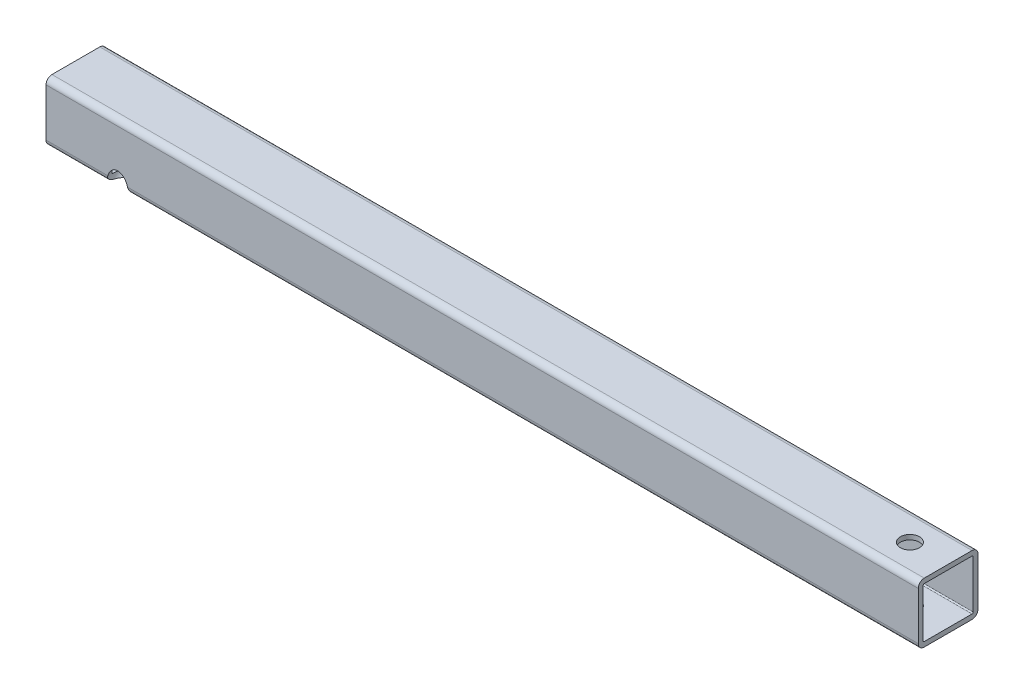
ISO-10303-21;
HEADER;
FILE_DESCRIPTION(('STEP AP214'),'2;1');
FILE_NAME('part.step','',(''),(''),'','','');
FILE_SCHEMA(('AUTOMOTIVE_DESIGN { 1 0 10303 214 1 1 1 1 }'));
ENDSEC;
DATA;
#1=APPLICATION_CONTEXT('core data for automotive mechanical design processes');
#2=APPLICATION_PROTOCOL_DEFINITION('international standard','automotive_design',2000,#1);
#3=PRODUCT_CONTEXT('',#1,'mechanical');
#4=PRODUCT('Part','Part','',(#3));
#5=PRODUCT_RELATED_PRODUCT_CATEGORY('part','',(#4));
#6=PRODUCT_DEFINITION_FORMATION('','',#4);
#7=PRODUCT_DEFINITION_CONTEXT('part definition',#1,'design');
#8=PRODUCT_DEFINITION('design','',#6,#7);
#9=PRODUCT_DEFINITION_SHAPE('','',#8);
#10=(LENGTH_UNIT() NAMED_UNIT(*) SI_UNIT(.MILLI.,.METRE.));
#11=(NAMED_UNIT(*) PLANE_ANGLE_UNIT() SI_UNIT($,.RADIAN.));
#12=(NAMED_UNIT(*) SI_UNIT($,.STERADIAN.) SOLID_ANGLE_UNIT());
#13=UNCERTAINTY_MEASURE_WITH_UNIT(LENGTH_MEASURE(1.E-05),#10,'distance_accuracy_value','');
#14=(GEOMETRIC_REPRESENTATION_CONTEXT(3) GLOBAL_UNCERTAINTY_ASSIGNED_CONTEXT((#13)) GLOBAL_UNIT_ASSIGNED_CONTEXT((#10,
#11,#12)) REPRESENTATION_CONTEXT('',''));
#15=CARTESIAN_POINT('',(0.,0.,0.));
#16=DIRECTION('',(0.,0.,1.));
#17=DIRECTION('',(1.,0.,0.));
#18=AXIS2_PLACEMENT_3D('',#15,#16,#17);
#19=CARTESIAN_POINT('',(365.,-10.,10.));
#20=DIRECTION('',(-1.,0.,0.));
#21=DIRECTION('',(0.,0.,1.));
#22=AXIS2_PLACEMENT_3D('',#19,#20,#21);
#23=CYLINDRICAL_SURFACE('',#22,2.5);
#24=DIRECTION('',(-1.,0.,0.));
#25=VECTOR('',#24,1.);
#26=CARTESIAN_POINT('',(365.,-9.99999999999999,12.5));
#27=LINE('',#26,#25);
#28=CARTESIAN_POINT('',(365.,-9.99999999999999,12.5));
#29=VERTEX_POINT('',#28);
#30=CARTESIAN_POINT('',(34.1382363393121,-9.99999999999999,12.5));
#31=VERTEX_POINT('',#30);
#32=EDGE_CURVE('E206',#29,#31,#27,.T.);
#33=ORIENTED_EDGE('',*,*,#32,.T.);
#34=CARTESIAN_POINT('',(34.1382363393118,-12.5,9.99999999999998));
#35=CARTESIAN_POINT('',(34.1587842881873,-12.4999928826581,10.0680174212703));
#36=CARTESIAN_POINT('',(34.1791785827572,-12.4972226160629,10.1360525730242));
#37=CARTESIAN_POINT('',(34.2192183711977,-12.4861052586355,10.2719220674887));
#38=CARTESIAN_POINT('',(34.2388634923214,-12.477755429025,10.3397562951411));
#39=CARTESIAN_POINT('',(34.2961355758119,-12.4441746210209,10.5430481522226));
#40=CARTESIAN_POINT('',(34.3319258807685,-12.4104114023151,10.6777409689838));
#41=CARTESIAN_POINT('',(34.3951296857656,-12.3200022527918,10.9418845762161));
#42=CARTESIAN_POINT('',(34.4225131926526,-12.2632760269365,11.071315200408));
#43=CARTESIAN_POINT('',(34.4656970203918,-12.1278395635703,11.3199405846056));
#44=CARTESIAN_POINT('',(34.4815271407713,-12.0491866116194,11.4391609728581));
#45=CARTESIAN_POINT('',(34.4990166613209,-11.879843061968,11.6532294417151));
#46=CARTESIAN_POINT('',(34.5017941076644,-11.7908063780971,11.7492971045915));
#47=CARTESIAN_POINT('',(34.495938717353,-11.5990054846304,11.9261859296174));
#48=CARTESIAN_POINT('',(34.487305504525,-11.496240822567,12.007006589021));
#49=CARTESIAN_POINT('',(34.4602823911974,-11.2863136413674,12.1472006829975));
#50=CARTESIAN_POINT('',(34.442447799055,-11.1796930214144,12.2075004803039));
#51=CARTESIAN_POINT('',(34.3989096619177,-10.9600700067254,12.3115054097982));
#52=CARTESIAN_POINT('',(34.3731972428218,-10.8470605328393,12.3551917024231));
#53=CARTESIAN_POINT('',(34.3147025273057,-10.612417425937,12.4270619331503));
#54=CARTESIAN_POINT('',(34.2816665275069,-10.4906213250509,12.4545093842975));
#55=CARTESIAN_POINT('',(34.2293878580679,-10.3069695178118,12.4818539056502));
#56=CARTESIAN_POINT('',(34.2115278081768,-10.2456578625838,12.4886643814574));
#57=CARTESIAN_POINT('',(34.175231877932,-10.1228923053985,12.4977341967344));
#58=CARTESIAN_POINT('',(34.1567962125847,-10.0614384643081,12.4999952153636));
#59=CARTESIAN_POINT('',(34.1382363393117,-10.,12.5));
#60=B_SPLINE_CURVE_WITH_KNOTS('',3,(#34,#35,#36,#37,#38,#39,#40,#41,#42,#43,#44,#45,#46,#47,#48,
#49,#50,#51,#52,#53,#54,#55,#56,#57,#58,#59),.UNSPECIFIED.,.F.,.F.,(4,2,2,2,2,2,2,2,2,2,2,2,4),
(0.,0.213047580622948,0.426199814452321,0.854225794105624,1.28376156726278,1.71218548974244,
2.10314834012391,2.49412407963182,2.86386745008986,3.23402886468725,3.61989764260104,
3.81242599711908,4.00488327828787),.UNSPECIFIED.);
#61=CARTESIAN_POINT('',(34.1382363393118,-12.5,9.99999999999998));
#62=VERTEX_POINT('',#61);
#63=EDGE_CURVE('E48',#62,#31,#60,.T.);
#64=ORIENTED_EDGE('',*,*,#63,.F.);
#65=DIRECTION('',(-1.,0.,0.));
#66=VECTOR('',#65,1.);
#67=CARTESIAN_POINT('',(365.,-12.5,9.99999999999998));
#68=LINE('',#67,#66);
#69=CARTESIAN_POINT('',(365.,-12.5,9.99999999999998));
#70=VERTEX_POINT('',#69);
#71=EDGE_CURVE('E11',#70,#62,#68,.T.);
#72=ORIENTED_EDGE('',*,*,#71,.F.);
#73=CARTESIAN_POINT('',(365.,-10.,10.));
#74=DIRECTION('',(1.,0.,0.));
#75=DIRECTION('',(0.,0.,-1.));
#76=AXIS2_PLACEMENT_3D('',#73,#74,#75);
#77=CIRCLE('',#76,2.5);
#78=EDGE_CURVE('E213',#29,#70,#77,.T.);
#79=ORIENTED_EDGE('',*,*,#78,.F.);
#80=EDGE_LOOP('',(#33,#64,#72,#79));
#81=FACE_BOUND('',#80,.T.);
#82=ADVANCED_FACE('F32',(#81),#23,.T.);
#83=CARTESIAN_POINT('',(365.,-10.,10.));
#84=DIRECTION('',(-1.,0.,0.));
#85=DIRECTION('',(0.,0.,1.));
#86=AXIS2_PLACEMENT_3D('',#83,#84,#85);
#87=CYLINDRICAL_SURFACE('',#86,0.5);
#88=CARTESIAN_POINT('',(34.4860896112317,-10.5,9.99999999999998));
#89=CARTESIAN_POINT('',(34.4876586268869,-10.5000230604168,10.0280963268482));
#90=CARTESIAN_POINT('',(34.4892206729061,-10.497633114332,10.0561876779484));
#91=CARTESIAN_POINT('',(34.4921701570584,-10.4881949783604,10.1115710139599));
#92=CARTESIAN_POINT('',(34.4935576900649,-10.4811493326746,10.1388634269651));
#93=CARTESIAN_POINT('',(34.496000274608,-10.4625616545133,10.191907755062));
#94=CARTESIAN_POINT('',(34.4970551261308,-10.4510169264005,10.2176587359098));
#95=CARTESIAN_POINT('',(34.4987132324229,-10.4237633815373,10.2668610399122));
#96=CARTESIAN_POINT('',(34.4993166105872,-10.4080557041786,10.2903129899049));
#97=CARTESIAN_POINT('',(34.500002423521,-10.3729887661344,10.3341624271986));
#98=CARTESIAN_POINT('',(34.500086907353,-10.3536441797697,10.3545716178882));
#99=CARTESIAN_POINT('',(34.4997309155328,-10.3118105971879,10.3918665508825));
#100=CARTESIAN_POINT('',(34.4992903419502,-10.2893210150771,10.4087516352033));
#101=CARTESIAN_POINT('',(34.4979353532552,-10.2419040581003,10.4384791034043));
#102=CARTESIAN_POINT('',(34.4970220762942,-10.2169826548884,10.4513310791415));
#103=CARTESIAN_POINT('',(34.4948239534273,-10.1653632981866,10.472688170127));
#104=CARTESIAN_POINT('',(34.4935392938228,-10.1386662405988,10.4811954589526));
#105=CARTESIAN_POINT('',(34.4912011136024,-10.0931841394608,10.4915986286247));
#106=CARTESIAN_POINT('',(34.4902097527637,-10.0746724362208,10.4947474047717));
#107=CARTESIAN_POINT('',(34.4881758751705,-10.0374429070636,10.4989477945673));
#108=CARTESIAN_POINT('',(34.4871334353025,-10.0187254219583,10.5000024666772));
#109=CARTESIAN_POINT('',(34.4860896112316,-10.,10.5));
#110=B_SPLINE_CURVE_WITH_KNOTS('',3,(#88,#89,#90,#91,#92,#93,#94,#95,#96,#97,#98,#99,#100,#101,
#102,#103,#104,#105,#106,#107,#108,#109),.UNSPECIFIED.,.F.,.F.,(4,2,2,2,2,2,2,2,2,2,4),(0.,
0.0843116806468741,0.168577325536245,0.252893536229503,0.337186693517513,0.421146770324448,
0.50512250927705,0.588896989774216,0.672629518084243,0.728930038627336,0.785148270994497),.UNSPECIFIED.);
#111=CARTESIAN_POINT('',(34.4860896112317,-10.5,9.99999999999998));
#112=VERTEX_POINT('',#111);
#113=CARTESIAN_POINT('',(34.4860896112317,-10.,10.5));
#114=VERTEX_POINT('',#113);
#115=EDGE_CURVE('E330',#112,#114,#110,.T.);
#116=ORIENTED_EDGE('',*,*,#115,.T.);
#117=DIRECTION('',(-1.,0.,0.));
#118=VECTOR('',#117,1.);
#119=CARTESIAN_POINT('',(365.,-10.,10.5));
#120=LINE('',#119,#118);
#121=CARTESIAN_POINT('',(365.,-10.,10.5));
#122=VERTEX_POINT('',#121);
#123=EDGE_CURVE('E246',#122,#114,#120,.T.);
#124=ORIENTED_EDGE('',*,*,#123,.F.);
#125=CARTESIAN_POINT('',(365.,-10.,10.));
#126=DIRECTION('',(1.,0.,0.));
#127=DIRECTION('',(0.,0.,-1.));
#128=AXIS2_PLACEMENT_3D('',#125,#126,#127);
#129=CIRCLE('',#128,0.5);
#130=CARTESIAN_POINT('',(365.,-10.5,9.99999999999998));
#131=VERTEX_POINT('',#130);
#132=EDGE_CURVE('E302',#122,#131,#129,.T.);
#133=ORIENTED_EDGE('',*,*,#132,.T.);
#134=DIRECTION('',(-1.,0.,0.));
#135=VECTOR('',#134,1.);
#136=CARTESIAN_POINT('',(365.,-10.5,9.99999999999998));
#137=LINE('',#136,#135);
#138=EDGE_CURVE('E250',#131,#112,#137,.T.);
#139=ORIENTED_EDGE('',*,*,#138,.T.);
#140=EDGE_LOOP('',(#116,#124,#133,#139));
#141=FACE_BOUND('',#140,.T.);
#142=ADVANCED_FACE('F369',(#141),#87,.F.);
#143=CARTESIAN_POINT('',(365.,-12.5,9.99999999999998));
#144=DIRECTION('',(0.,1.,0.));
#145=DIRECTION('',(0.,0.,1.));
#146=AXIS2_PLACEMENT_3D('',#143,#144,#145);
#147=PLANE('',#146);
#148=ORIENTED_EDGE('',*,*,#71,.T.);
#149=CARTESIAN_POINT('',(30.,-12.5,12.5));
#150=DIRECTION('',(0.,1.,0.));
#151=DIRECTION('',(0.,0.,1.));
#152=AXIS2_PLACEMENT_3D('',#149,#150,#151);
#153=ELLIPSE('',#152,6.36396103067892,4.5);
#154=CARTESIAN_POINT('',(25.8617636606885,-12.5,9.99999999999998));
#155=VERTEX_POINT('',#154);
#156=EDGE_CURVE('E171',#155,#62,#153,.F.);
#157=ORIENTED_EDGE('',*,*,#156,.F.);
#158=CARTESIAN_POINT('',(0.,-12.5,9.99999999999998));
#159=VERTEX_POINT('',#158);
#160=EDGE_CURVE('E41',#155,#159,#68,.T.);
#161=ORIENTED_EDGE('',*,*,#160,.T.);
#162=DIRECTION('',(0.,0.,-1.));
#163=VECTOR('',#162,1.);
#164=CARTESIAN_POINT('',(0.,-12.5,9.99999999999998));
#165=LINE('',#164,#163);
#166=CARTESIAN_POINT('',(0.,-12.5,-9.99999999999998));
#167=VERTEX_POINT('',#166);
#168=EDGE_CURVE('E224',#159,#167,#165,.T.);
#169=ORIENTED_EDGE('',*,*,#168,.T.);
#170=DIRECTION('',(-1.,0.,0.));
#171=VECTOR('',#170,1.);
#172=CARTESIAN_POINT('',(365.,-12.5,-9.99999999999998));
#173=LINE('',#172,#171);
#174=CARTESIAN_POINT('',(365.,-12.5,-9.99999999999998));
#175=VERTEX_POINT('',#174);
#176=EDGE_CURVE('E187',#175,#167,#173,.T.);
#177=ORIENTED_EDGE('',*,*,#176,.F.);
#178=DIRECTION('',(0.,0.,-1.));
#179=VECTOR('',#178,1.);
#180=CARTESIAN_POINT('',(365.,-12.5,9.99999999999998));
#181=LINE('',#180,#179);
#182=EDGE_CURVE('E240',#70,#175,#181,.T.);
#183=ORIENTED_EDGE('',*,*,#182,.F.);
#184=EDGE_LOOP('',(#148,#157,#161,#169,#177,#183));
#185=FACE_BOUND('',#184,.T.);
#186=CARTESIAN_POINT('',(349.,-12.5,0.));
#187=DIRECTION('',(0.,-1.,0.));
#188=DIRECTION('',(0.,0.,-1.));
#189=AXIS2_PLACEMENT_3D('',#186,#187,#188);
#190=CIRCLE('',#189,3.99999999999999);
#191=CARTESIAN_POINT('',(349.,-12.5,-3.99999999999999));
#192=VERTEX_POINT('',#191);
#193=EDGE_CURVE('E311',#192,#192,#190,.T.);
#194=ORIENTED_EDGE('',*,*,#193,.F.);
#195=EDGE_LOOP('',(#194));
#196=FACE_BOUND('',#195,.T.);
#197=ADVANCED_FACE('F178',(#185,#196),#147,.F.);
#198=CARTESIAN_POINT('',(365.,12.5,9.99999999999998));
#199=DIRECTION('',(0.,-1.,0.));
#200=DIRECTION('',(0.,0.,-1.));
#201=AXIS2_PLACEMENT_3D('',#198,#199,#200);
#202=PLANE('',#201);
#203=DIRECTION('',(0.,0.,1.));
#204=VECTOR('',#203,1.);
#205=CARTESIAN_POINT('',(0.,12.5,9.99999999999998));
#206=LINE('',#205,#204);
#207=CARTESIAN_POINT('',(0.,12.5,-9.99999999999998));
#208=VERTEX_POINT('',#207);
#209=CARTESIAN_POINT('',(0.,12.5,9.99999999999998));
#210=VERTEX_POINT('',#209);
#211=EDGE_CURVE('E216',#208,#210,#206,.T.);
#212=ORIENTED_EDGE('',*,*,#211,.T.);
#213=DIRECTION('',(-1.,0.,0.));
#214=VECTOR('',#213,1.);
#215=CARTESIAN_POINT('',(365.,12.5,9.99999999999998));
#216=LINE('',#215,#214);
#217=CARTESIAN_POINT('',(365.,12.5,9.99999999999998));
#218=VERTEX_POINT('',#217);
#219=EDGE_CURVE('E200',#218,#210,#216,.T.);
#220=ORIENTED_EDGE('',*,*,#219,.F.);
#221=DIRECTION('',(0.,0.,1.));
#222=VECTOR('',#221,1.);
#223=CARTESIAN_POINT('',(365.,12.5,9.99999999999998));
#224=LINE('',#223,#222);
#225=CARTESIAN_POINT('',(365.,12.5,-9.99999999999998));
#226=VERTEX_POINT('',#225);
#227=EDGE_CURVE('E232',#226,#218,#224,.T.);
#228=ORIENTED_EDGE('',*,*,#227,.F.);
#229=DIRECTION('',(-1.,0.,0.));
#230=VECTOR('',#229,1.);
#231=CARTESIAN_POINT('',(365.,12.5,-9.99999999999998));
#232=LINE('',#231,#230);
#233=EDGE_CURVE('E197',#226,#208,#232,.T.);
#234=ORIENTED_EDGE('',*,*,#233,.T.);
#235=EDGE_LOOP('',(#212,#220,#228,#234));
#236=FACE_BOUND('',#235,.T.);
#237=CARTESIAN_POINT('',(349.,12.5,0.));
#238=DIRECTION('',(0.,-1.,0.));
#239=DIRECTION('',(0.,0.,-1.));
#240=AXIS2_PLACEMENT_3D('',#237,#238,#239);
#241=CIRCLE('',#240,3.99999999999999);
#242=CARTESIAN_POINT('',(349.,12.5,-3.99999999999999));
#243=VERTEX_POINT('',#242);
#244=EDGE_CURVE('E182',#243,#243,#241,.T.);
#245=ORIENTED_EDGE('',*,*,#244,.T.);
#246=EDGE_LOOP('',(#245));
#247=FACE_BOUND('',#246,.T.);
#248=ADVANCED_FACE('F403',(#236,#247),#202,.F.);
#249=CARTESIAN_POINT('',(365.,-10.5,9.99999999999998));
#250=DIRECTION('',(0.,1.,0.));
#251=DIRECTION('',(0.,0.,1.));
#252=AXIS2_PLACEMENT_3D('',#249,#250,#251);
#253=PLANE('',#252);
#254=CARTESIAN_POINT('',(30.,-10.5,10.5));
#255=DIRECTION('',(0.,1.,0.));
#256=DIRECTION('',(0.,0.,1.));
#257=AXIS2_PLACEMENT_3D('',#254,#255,#256);
#258=ELLIPSE('',#257,6.36396103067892,4.5);
#259=CARTESIAN_POINT('',(25.5139103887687,-10.5,9.99999999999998));
#260=VERTEX_POINT('',#259);
#261=EDGE_CURVE('E56',#260,#112,#258,.F.);
#262=ORIENTED_EDGE('',*,*,#261,.T.);
#263=ORIENTED_EDGE('',*,*,#138,.F.);
#264=DIRECTION('',(0.,0.,-1.));
#265=VECTOR('',#264,1.);
#266=CARTESIAN_POINT('',(365.,-10.5,9.99999999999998));
#267=LINE('',#266,#265);
#268=CARTESIAN_POINT('',(365.,-10.5,-10.));
#269=VERTEX_POINT('',#268);
#270=EDGE_CURVE('E300',#131,#269,#267,.T.);
#271=ORIENTED_EDGE('',*,*,#270,.T.);
#272=DIRECTION('',(-1.,0.,0.));
#273=VECTOR('',#272,1.);
#274=CARTESIAN_POINT('',(365.,-10.5,-10.));
#275=LINE('',#274,#273);
#276=CARTESIAN_POINT('',(0.,-10.5,-10.));
#277=VERTEX_POINT('',#276);
#278=EDGE_CURVE('E254',#269,#277,#275,.T.);
#279=ORIENTED_EDGE('',*,*,#278,.T.);
#280=DIRECTION('',(0.,0.,-1.));
#281=VECTOR('',#280,1.);
#282=CARTESIAN_POINT('',(0.,-10.5,9.99999999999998));
#283=LINE('',#282,#281);
#284=CARTESIAN_POINT('',(0.,-10.5,9.99999999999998));
#285=VERTEX_POINT('',#284);
#286=EDGE_CURVE('E279',#285,#277,#283,.T.);
#287=ORIENTED_EDGE('',*,*,#286,.F.);
#288=EDGE_CURVE('E253',#260,#285,#137,.T.);
#289=ORIENTED_EDGE('',*,*,#288,.F.);
#290=EDGE_LOOP('',(#262,#263,#271,#279,#287,#289));
#291=FACE_BOUND('',#290,.T.);
#292=CARTESIAN_POINT('',(349.,-10.5,0.));
#293=DIRECTION('',(0.,1.,0.));
#294=DIRECTION('',(0.,0.,1.));
#295=AXIS2_PLACEMENT_3D('',#292,#293,#294);
#296=CIRCLE('',#295,3.99999999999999);
#297=CARTESIAN_POINT('',(349.,-10.5,3.99999999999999));
#298=VERTEX_POINT('',#297);
#299=EDGE_CURVE('E291',#298,#298,#296,.F.);
#300=ORIENTED_EDGE('',*,*,#299,.T.);
#301=EDGE_LOOP('',(#300));
#302=FACE_BOUND('',#301,.T.);
#303=ADVANCED_FACE('F372',(#291,#302),#253,.T.);
#304=CARTESIAN_POINT('',(365.,10.5,9.99999999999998));
#305=DIRECTION('',(0.,-1.,0.));
#306=DIRECTION('',(0.,0.,-1.));
#307=AXIS2_PLACEMENT_3D('',#304,#305,#306);
#308=PLANE('',#307);
#309=DIRECTION('',(0.,0.,1.));
#310=VECTOR('',#309,1.);
#311=CARTESIAN_POINT('',(0.,10.5,9.99999999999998));
#312=LINE('',#311,#310);
#313=CARTESIAN_POINT('',(0.,10.5,-9.99999999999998));
#314=VERTEX_POINT('',#313);
#315=CARTESIAN_POINT('',(0.,10.5,9.99999999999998));
#316=VERTEX_POINT('',#315);
#317=EDGE_CURVE('E266',#314,#316,#312,.T.);
#318=ORIENTED_EDGE('',*,*,#317,.F.);
#319=DIRECTION('',(-1.,0.,0.));
#320=VECTOR('',#319,1.);
#321=CARTESIAN_POINT('',(365.,10.5,-9.99999999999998));
#322=LINE('',#321,#320);
#323=CARTESIAN_POINT('',(365.,10.5,-9.99999999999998));
#324=VERTEX_POINT('',#323);
#325=EDGE_CURVE('E260',#324,#314,#322,.T.);
#326=ORIENTED_EDGE('',*,*,#325,.F.);
#327=DIRECTION('',(0.,0.,1.));
#328=VECTOR('',#327,1.);
#329=CARTESIAN_POINT('',(365.,10.5,9.99999999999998));
#330=LINE('',#329,#328);
#331=CARTESIAN_POINT('',(365.,10.5,9.99999999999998));
#332=VERTEX_POINT('',#331);
#333=EDGE_CURVE('E265',#324,#332,#330,.T.);
#334=ORIENTED_EDGE('',*,*,#333,.T.);
#335=DIRECTION('',(-1.,0.,0.));
#336=VECTOR('',#335,1.);
#337=CARTESIAN_POINT('',(365.,10.5,9.99999999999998));
#338=LINE('',#337,#336);
#339=EDGE_CURVE('E262',#332,#316,#338,.T.);
#340=ORIENTED_EDGE('',*,*,#339,.T.);
#341=EDGE_LOOP('',(#318,#326,#334,#340));
#342=FACE_BOUND('',#341,.T.);
#343=CARTESIAN_POINT('',(349.,10.5,0.));
#344=DIRECTION('',(0.,-1.,0.));
#345=DIRECTION('',(0.,0.,-1.));
#346=AXIS2_PLACEMENT_3D('',#343,#344,#345);
#347=CIRCLE('',#346,3.99999999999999);
#348=CARTESIAN_POINT('',(349.,10.5,-3.99999999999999));
#349=VERTEX_POINT('',#348);
#350=EDGE_CURVE('E36',#349,#349,#347,.F.);
#351=ORIENTED_EDGE('',*,*,#350,.T.);
#352=EDGE_LOOP('',(#351));
#353=FACE_BOUND('',#352,.T.);
#354=ADVANCED_FACE('F390',(#342,#353),#308,.T.);
#355=CARTESIAN_POINT('',(365.,-10.,10.));
#356=DIRECTION('',(1.,0.,0.));
#357=DIRECTION('',(0.,0.,-1.));
#358=AXIS2_PLACEMENT_3D('',#355,#356,#357);
#359=PLANE('',#358);
#360=ORIENTED_EDGE('',*,*,#78,.T.);
#361=ORIENTED_EDGE('',*,*,#182,.T.);
#362=CARTESIAN_POINT('',(365.,-10.,-10.));
#363=DIRECTION('',(1.,0.,0.));
#364=DIRECTION('',(0.,0.,-1.));
#365=AXIS2_PLACEMENT_3D('',#362,#363,#364);
#366=CIRCLE('',#365,2.5);
#367=CARTESIAN_POINT('',(365.,-9.99999999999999,-12.5));
#368=VERTEX_POINT('',#367);
#369=EDGE_CURVE('E238',#175,#368,#366,.T.);
#370=ORIENTED_EDGE('',*,*,#369,.T.);
#371=DIRECTION('',(0.,1.,0.));
#372=VECTOR('',#371,1.);
#373=CARTESIAN_POINT('',(365.,9.99999999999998,-12.5));
#374=LINE('',#373,#372);
#375=CARTESIAN_POINT('',(365.,9.99999999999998,-12.5));
#376=VERTEX_POINT('',#375);
#377=EDGE_CURVE('E236',#368,#376,#374,.T.);
#378=ORIENTED_EDGE('',*,*,#377,.T.);
#379=CARTESIAN_POINT('',(365.,10.,-10.));
#380=DIRECTION('',(1.,0.,0.));
#381=DIRECTION('',(0.,0.,1.));
#382=AXIS2_PLACEMENT_3D('',#379,#380,#381);
#383=CIRCLE('',#382,2.5);
#384=EDGE_CURVE('E234',#376,#226,#383,.T.);
#385=ORIENTED_EDGE('',*,*,#384,.T.);
#386=ORIENTED_EDGE('',*,*,#227,.T.);
#387=CARTESIAN_POINT('',(365.,10.,10.));
#388=DIRECTION('',(1.,0.,0.));
#389=DIRECTION('',(0.,0.,-1.));
#390=AXIS2_PLACEMENT_3D('',#387,#388,#389);
#391=CIRCLE('',#390,2.5);
#392=CARTESIAN_POINT('',(365.,9.99999999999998,12.5));
#393=VERTEX_POINT('',#392);
#394=EDGE_CURVE('E230',#218,#393,#391,.T.);
#395=ORIENTED_EDGE('',*,*,#394,.T.);
#396=DIRECTION('',(0.,-1.,0.));
#397=VECTOR('',#396,1.);
#398=CARTESIAN_POINT('',(365.,9.99999999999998,12.5));
#399=LINE('',#398,#397);
#400=EDGE_CURVE('E228',#393,#29,#399,.T.);
#401=ORIENTED_EDGE('',*,*,#400,.T.);
#402=EDGE_LOOP('',(#360,#361,#370,#378,#385,#386,#395,#401));
#403=FACE_BOUND('',#402,.T.);
#404=DIRECTION('',(0.,-1.,0.));
#405=VECTOR('',#404,1.);
#406=CARTESIAN_POINT('',(365.,9.99999999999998,10.5));
#407=LINE('',#406,#405);
#408=CARTESIAN_POINT('',(365.,9.99999999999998,10.5));
#409=VERTEX_POINT('',#408);
#410=EDGE_CURVE('E304',#409,#122,#407,.T.);
#411=ORIENTED_EDGE('',*,*,#410,.F.);
#412=CARTESIAN_POINT('',(365.,10.,10.));
#413=DIRECTION('',(1.,0.,0.));
#414=DIRECTION('',(0.,0.,-1.));
#415=AXIS2_PLACEMENT_3D('',#412,#413,#414);
#416=CIRCLE('',#415,0.5);
#417=EDGE_CURVE('E269',#332,#409,#416,.T.);
#418=ORIENTED_EDGE('',*,*,#417,.F.);
#419=ORIENTED_EDGE('',*,*,#333,.F.);
#420=CARTESIAN_POINT('',(365.,10.,-10.));
#421=DIRECTION('',(1.,0.,0.));
#422=DIRECTION('',(0.,0.,1.));
#423=AXIS2_PLACEMENT_3D('',#420,#421,#422);
#424=CIRCLE('',#423,0.5);
#425=CARTESIAN_POINT('',(365.,9.99999999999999,-10.5));
#426=VERTEX_POINT('',#425);
#427=EDGE_CURVE('E293',#426,#324,#424,.T.);
#428=ORIENTED_EDGE('',*,*,#427,.F.);
#429=DIRECTION('',(0.,1.,0.));
#430=VECTOR('',#429,1.);
#431=CARTESIAN_POINT('',(365.,9.99999999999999,-10.5));
#432=LINE('',#431,#430);
#433=CARTESIAN_POINT('',(365.,-9.99999999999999,-10.5));
#434=VERTEX_POINT('',#433);
#435=EDGE_CURVE('E296',#434,#426,#432,.T.);
#436=ORIENTED_EDGE('',*,*,#435,.F.);
#437=CARTESIAN_POINT('',(365.,-10.,-10.));
#438=DIRECTION('',(1.,0.,0.));
#439=DIRECTION('',(0.,0.,-1.));
#440=AXIS2_PLACEMENT_3D('',#437,#438,#439);
#441=CIRCLE('',#440,0.499999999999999);
#442=EDGE_CURVE('E298',#269,#434,#441,.T.);
#443=ORIENTED_EDGE('',*,*,#442,.F.);
#444=ORIENTED_EDGE('',*,*,#270,.F.);
#445=ORIENTED_EDGE('',*,*,#132,.F.);
#446=EDGE_LOOP('',(#411,#418,#419,#428,#436,#443,#444,#445));
#447=FACE_BOUND('',#446,.T.);
#448=ADVANCED_FACE('F364',(#403,#447),#359,.T.);
#449=CARTESIAN_POINT('',(0.,-10.,10.));
#450=DIRECTION('',(1.,0.,0.));
#451=DIRECTION('',(0.,0.,-1.));
#452=AXIS2_PLACEMENT_3D('',#449,#450,#451);
#453=PLANE('',#452);
#454=CARTESIAN_POINT('',(0.,-10.,10.));
#455=DIRECTION('',(1.,0.,0.));
#456=DIRECTION('',(0.,0.,-1.));
#457=AXIS2_PLACEMENT_3D('',#454,#455,#456);
#458=CIRCLE('',#457,2.5);
#459=CARTESIAN_POINT('',(0.,-9.99999999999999,12.5));
#460=VERTEX_POINT('',#459);
#461=EDGE_CURVE('E186',#460,#159,#458,.T.);
#462=ORIENTED_EDGE('',*,*,#461,.F.);
#463=DIRECTION('',(0.,-1.,0.));
#464=VECTOR('',#463,1.);
#465=CARTESIAN_POINT('',(0.,9.99999999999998,12.5));
#466=LINE('',#465,#464);
#467=CARTESIAN_POINT('',(0.,9.99999999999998,12.5));
#468=VERTEX_POINT('',#467);
#469=EDGE_CURVE('E210',#468,#460,#466,.T.);
#470=ORIENTED_EDGE('',*,*,#469,.F.);
#471=CARTESIAN_POINT('',(0.,10.,10.));
#472=DIRECTION('',(1.,0.,0.));
#473=DIRECTION('',(0.,0.,-1.));
#474=AXIS2_PLACEMENT_3D('',#471,#472,#473);
#475=CIRCLE('',#474,2.5);
#476=EDGE_CURVE('E214',#210,#468,#475,.T.);
#477=ORIENTED_EDGE('',*,*,#476,.F.);
#478=ORIENTED_EDGE('',*,*,#211,.F.);
#479=CARTESIAN_POINT('',(0.,10.,-10.));
#480=DIRECTION('',(1.,0.,0.));
#481=DIRECTION('',(0.,0.,1.));
#482=AXIS2_PLACEMENT_3D('',#479,#480,#481);
#483=CIRCLE('',#482,2.5);
#484=CARTESIAN_POINT('',(0.,9.99999999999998,-12.5));
#485=VERTEX_POINT('',#484);
#486=EDGE_CURVE('E218',#485,#208,#483,.T.);
#487=ORIENTED_EDGE('',*,*,#486,.F.);
#488=DIRECTION('',(0.,1.,0.));
#489=VECTOR('',#488,1.);
#490=CARTESIAN_POINT('',(0.,9.99999999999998,-12.5));
#491=LINE('',#490,#489);
#492=CARTESIAN_POINT('',(0.,-9.99999999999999,-12.5));
#493=VERTEX_POINT('',#492);
#494=EDGE_CURVE('E220',#493,#485,#491,.T.);
#495=ORIENTED_EDGE('',*,*,#494,.F.);
#496=CARTESIAN_POINT('',(0.,-10.,-10.));
#497=DIRECTION('',(1.,0.,0.));
#498=DIRECTION('',(0.,0.,-1.));
#499=AXIS2_PLACEMENT_3D('',#496,#497,#498);
#500=CIRCLE('',#499,2.5);
#501=EDGE_CURVE('E222',#167,#493,#500,.T.);
#502=ORIENTED_EDGE('',*,*,#501,.F.);
#503=ORIENTED_EDGE('',*,*,#168,.F.);
#504=EDGE_LOOP('',(#462,#470,#477,#478,#487,#495,#502,#503));
#505=FACE_BOUND('',#504,.T.);
#506=CARTESIAN_POINT('',(0.,10.,10.));
#507=DIRECTION('',(1.,0.,0.));
#508=DIRECTION('',(0.,0.,-1.));
#509=AXIS2_PLACEMENT_3D('',#506,#507,#508);
#510=CIRCLE('',#509,0.5);
#511=CARTESIAN_POINT('',(0.,9.99999999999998,10.5));
#512=VERTEX_POINT('',#511);
#513=EDGE_CURVE('E288',#316,#512,#510,.T.);
#514=ORIENTED_EDGE('',*,*,#513,.T.);
#515=DIRECTION('',(0.,-1.,0.));
#516=VECTOR('',#515,1.);
#517=CARTESIAN_POINT('',(0.,9.99999999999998,10.5));
#518=LINE('',#517,#516);
#519=CARTESIAN_POINT('',(0.,-10.,10.5));
#520=VERTEX_POINT('',#519);
#521=EDGE_CURVE('E285',#512,#520,#518,.T.);
#522=ORIENTED_EDGE('',*,*,#521,.T.);
#523=CARTESIAN_POINT('',(0.,-10.,10.));
#524=DIRECTION('',(1.,0.,0.));
#525=DIRECTION('',(0.,0.,-1.));
#526=AXIS2_PLACEMENT_3D('',#523,#524,#525);
#527=CIRCLE('',#526,0.5);
#528=EDGE_CURVE('E282',#520,#285,#527,.T.);
#529=ORIENTED_EDGE('',*,*,#528,.T.);
#530=ORIENTED_EDGE('',*,*,#286,.T.);
#531=CARTESIAN_POINT('',(0.,-10.,-10.));
#532=DIRECTION('',(1.,0.,0.));
#533=DIRECTION('',(0.,0.,-1.));
#534=AXIS2_PLACEMENT_3D('',#531,#532,#533);
#535=CIRCLE('',#534,0.499999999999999);
#536=CARTESIAN_POINT('',(0.,-9.99999999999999,-10.5));
#537=VERTEX_POINT('',#536);
#538=EDGE_CURVE('E276',#277,#537,#535,.T.);
#539=ORIENTED_EDGE('',*,*,#538,.T.);
#540=DIRECTION('',(0.,1.,0.));
#541=VECTOR('',#540,1.);
#542=CARTESIAN_POINT('',(0.,9.99999999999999,-10.5));
#543=LINE('',#542,#541);
#544=CARTESIAN_POINT('',(0.,9.99999999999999,-10.5));
#545=VERTEX_POINT('',#544);
#546=EDGE_CURVE('E273',#537,#545,#543,.T.);
#547=ORIENTED_EDGE('',*,*,#546,.T.);
#548=CARTESIAN_POINT('',(0.,10.,-10.));
#549=DIRECTION('',(1.,0.,0.));
#550=DIRECTION('',(0.,0.,1.));
#551=AXIS2_PLACEMENT_3D('',#548,#549,#550);
#552=CIRCLE('',#551,0.5);
#553=EDGE_CURVE('E270',#545,#314,#552,.T.);
#554=ORIENTED_EDGE('',*,*,#553,.T.);
#555=ORIENTED_EDGE('',*,*,#317,.T.);
#556=EDGE_LOOP('',(#514,#522,#529,#530,#539,#547,#554,#555));
#557=FACE_BOUND('',#556,.T.);
#558=ADVANCED_FACE('F355',(#505,#557),#453,.F.);
#559=ORIENTED_EDGE('',*,*,#160,.F.);
#560=CARTESIAN_POINT('',(25.8617636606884,-9.99999999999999,12.5));
#561=CARTESIAN_POINT('',(25.8412157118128,-10.0680174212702,12.4999928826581));
#562=CARTESIAN_POINT('',(25.8208214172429,-10.1360525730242,12.4972226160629));
#563=CARTESIAN_POINT('',(25.7807816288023,-10.2719220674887,12.4861052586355));
#564=CARTESIAN_POINT('',(25.7611365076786,-10.3397562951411,12.477755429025));
#565=CARTESIAN_POINT('',(25.7038644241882,-10.5430481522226,12.4441746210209));
#566=CARTESIAN_POINT('',(25.6680741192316,-10.6777409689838,12.4104114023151));
#567=CARTESIAN_POINT('',(25.6048703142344,-10.9418845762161,12.3200022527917));
#568=CARTESIAN_POINT('',(25.5774868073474,-11.071315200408,12.2632760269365));
#569=CARTESIAN_POINT('',(25.5343029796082,-11.3199405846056,12.1278395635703));
#570=CARTESIAN_POINT('',(25.5184728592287,-11.4391609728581,12.0491866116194));
#571=CARTESIAN_POINT('',(25.5009833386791,-11.6532294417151,11.879843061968));
#572=CARTESIAN_POINT('',(25.4982058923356,-11.7492971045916,11.7908063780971));
#573=CARTESIAN_POINT('',(25.5040612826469,-11.9261859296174,11.5990054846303));
#574=CARTESIAN_POINT('',(25.512694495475,-12.0070065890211,11.4962408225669));
#575=CARTESIAN_POINT('',(25.5397176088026,-12.1472006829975,11.2863136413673));
#576=CARTESIAN_POINT('',(25.557552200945,-12.207500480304,11.1796930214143));
#577=CARTESIAN_POINT('',(25.6010903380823,-12.3115054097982,10.9600700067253));
#578=CARTESIAN_POINT('',(25.6268027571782,-12.3551917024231,10.8470605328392));
#579=CARTESIAN_POINT('',(25.6852974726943,-12.4270619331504,10.6124174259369));
#580=CARTESIAN_POINT('',(25.7183334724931,-12.4545093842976,10.4906213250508));
#581=CARTESIAN_POINT('',(25.7706121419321,-12.4818539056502,10.3069695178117));
#582=CARTESIAN_POINT('',(25.7884721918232,-12.4886643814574,10.2456578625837));
#583=CARTESIAN_POINT('',(25.824768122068,-12.4977341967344,10.1228923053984));
#584=CARTESIAN_POINT('',(25.8432037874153,-12.4999952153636,10.061438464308));
#585=CARTESIAN_POINT('',(25.8617636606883,-12.5,9.99999999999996));
#586=B_SPLINE_CURVE_WITH_KNOTS('',3,(#560,#561,#562,#563,#564,#565,#566,#567,#568,#569,#570,
#571,#572,#573,#574,#575,#576,#577,#578,#579,#580,#581,#582,#583,#584,#585),.UNSPECIFIED.,.F.,
.F.,(4,2,2,2,2,2,2,2,2,2,2,2,4),(0.,0.21304758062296,0.426199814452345,0.854225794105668,
1.28376156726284,1.71218548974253,2.10314834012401,2.49412407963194,2.86386745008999,
3.23402886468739,3.61989764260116,3.81242599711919,4.00488327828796),.UNSPECIFIED.);
#587=CARTESIAN_POINT('',(25.8617636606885,-9.99999999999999,12.5));
#588=VERTEX_POINT('',#587);
#589=EDGE_CURVE('E168',#588,#155,#586,.T.);
#590=ORIENTED_EDGE('',*,*,#589,.F.);
#591=EDGE_CURVE('E209',#588,#460,#27,.T.);
#592=ORIENTED_EDGE('',*,*,#591,.T.);
#593=ORIENTED_EDGE('',*,*,#461,.T.);
#594=EDGE_LOOP('',(#559,#590,#592,#593));
#595=FACE_BOUND('',#594,.T.);
#596=ADVANCED_FACE('F34',(#595),#23,.T.);
#597=CARTESIAN_POINT('',(365.,-10.,-10.));
#598=DIRECTION('',(-1.,0.,0.));
#599=DIRECTION('',(0.,0.,1.));
#600=AXIS2_PLACEMENT_3D('',#597,#598,#599);
#601=CYLINDRICAL_SURFACE('',#600,2.5);
#602=ORIENTED_EDGE('',*,*,#501,.T.);
#603=DIRECTION('',(-1.,0.,0.));
#604=VECTOR('',#603,1.);
#605=CARTESIAN_POINT('',(365.,-9.99999999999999,-12.5));
#606=LINE('',#605,#604);
#607=EDGE_CURVE('E189',#368,#493,#606,.T.);
#608=ORIENTED_EDGE('',*,*,#607,.F.);
#609=ORIENTED_EDGE('',*,*,#369,.F.);
#610=ORIENTED_EDGE('',*,*,#176,.T.);
#611=EDGE_LOOP('',(#602,#608,#609,#610));
#612=FACE_BOUND('',#611,.T.);
#613=ADVANCED_FACE('F421',(#612),#601,.T.);
#614=CARTESIAN_POINT('',(365.,9.99999999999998,-12.5));
#615=DIRECTION('',(0.,0.,1.));
#616=DIRECTION('',(0.,-1.,0.));
#617=AXIS2_PLACEMENT_3D('',#614,#615,#616);
#618=PLANE('',#617);
#619=ORIENTED_EDGE('',*,*,#494,.T.);
#620=DIRECTION('',(-1.,0.,0.));
#621=VECTOR('',#620,1.);
#622=CARTESIAN_POINT('',(365.,9.99999999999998,-12.5));
#623=LINE('',#622,#621);
#624=EDGE_CURVE('E194',#376,#485,#623,.T.);
#625=ORIENTED_EDGE('',*,*,#624,.F.);
#626=ORIENTED_EDGE('',*,*,#377,.F.);
#627=ORIENTED_EDGE('',*,*,#607,.T.);
#628=EDGE_LOOP('',(#619,#625,#626,#627));
#629=FACE_BOUND('',#628,.T.);
#630=ADVANCED_FACE('F426',(#629),#618,.F.);
#631=CARTESIAN_POINT('',(365.,10.,-10.));
#632=DIRECTION('',(-1.,0.,0.));
#633=DIRECTION('',(0.,0.,1.));
#634=AXIS2_PLACEMENT_3D('',#631,#632,#633);
#635=CYLINDRICAL_SURFACE('',#634,2.5);
#636=ORIENTED_EDGE('',*,*,#486,.T.);
#637=ORIENTED_EDGE('',*,*,#233,.F.);
#638=ORIENTED_EDGE('',*,*,#384,.F.);
#639=ORIENTED_EDGE('',*,*,#624,.T.);
#640=EDGE_LOOP('',(#636,#637,#638,#639));
#641=FACE_BOUND('',#640,.T.);
#642=ADVANCED_FACE('F443',(#641),#635,.T.);
#643=CARTESIAN_POINT('',(365.,10.,10.));
#644=DIRECTION('',(-1.,0.,0.));
#645=DIRECTION('',(0.,0.,1.));
#646=AXIS2_PLACEMENT_3D('',#643,#644,#645);
#647=CYLINDRICAL_SURFACE('',#646,2.5);
#648=ORIENTED_EDGE('',*,*,#476,.T.);
#649=DIRECTION('',(-1.,0.,0.));
#650=VECTOR('',#649,1.);
#651=CARTESIAN_POINT('',(365.,9.99999999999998,12.5));
#652=LINE('',#651,#650);
#653=EDGE_CURVE('E203',#393,#468,#652,.T.);
#654=ORIENTED_EDGE('',*,*,#653,.F.);
#655=ORIENTED_EDGE('',*,*,#394,.F.);
#656=ORIENTED_EDGE('',*,*,#219,.T.);
#657=EDGE_LOOP('',(#648,#654,#655,#656));
#658=FACE_BOUND('',#657,.T.);
#659=ADVANCED_FACE('F440',(#658),#647,.T.);
#660=CARTESIAN_POINT('',(365.,9.99999999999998,12.5));
#661=DIRECTION('',(0.,0.,-1.));
#662=DIRECTION('',(0.,1.,0.));
#663=AXIS2_PLACEMENT_3D('',#660,#661,#662);
#664=PLANE('',#663);
#665=ORIENTED_EDGE('',*,*,#591,.F.);
#666=CARTESIAN_POINT('',(30.,-12.5000000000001,12.5));
#667=DIRECTION('',(0.,0.,-1.));
#668=DIRECTION('',(0.,-1.,0.));
#669=AXIS2_PLACEMENT_3D('',#666,#667,#668);
#670=ELLIPSE('',#669,6.36396103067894,4.5);
#671=EDGE_CURVE('E172',#31,#588,#670,.F.);
#672=ORIENTED_EDGE('',*,*,#671,.F.);
#673=ORIENTED_EDGE('',*,*,#32,.F.);
#674=ORIENTED_EDGE('',*,*,#400,.F.);
#675=ORIENTED_EDGE('',*,*,#653,.T.);
#676=ORIENTED_EDGE('',*,*,#469,.T.);
#677=EDGE_LOOP('',(#665,#672,#673,#674,#675,#676));
#678=FACE_BOUND('',#677,.T.);
#679=ADVANCED_FACE('F438',(#678),#664,.F.);
#680=CARTESIAN_POINT('',(365.,10.,10.));
#681=DIRECTION('',(-1.,0.,0.));
#682=DIRECTION('',(0.,0.,1.));
#683=AXIS2_PLACEMENT_3D('',#680,#681,#682);
#684=CYLINDRICAL_SURFACE('',#683,0.5);
#685=ORIENTED_EDGE('',*,*,#513,.F.);
#686=ORIENTED_EDGE('',*,*,#339,.F.);
#687=ORIENTED_EDGE('',*,*,#417,.T.);
#688=DIRECTION('',(-1.,0.,0.));
#689=VECTOR('',#688,1.);
#690=CARTESIAN_POINT('',(365.,9.99999999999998,10.5));
#691=LINE('',#690,#689);
#692=EDGE_CURVE('E227',#409,#512,#691,.T.);
#693=ORIENTED_EDGE('',*,*,#692,.T.);
#694=EDGE_LOOP('',(#685,#686,#687,#693));
#695=FACE_BOUND('',#694,.T.);
#696=ADVANCED_FACE('F359',(#695),#684,.F.);
#697=CARTESIAN_POINT('',(365.,9.99999999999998,10.5));
#698=DIRECTION('',(0.,0.,-1.));
#699=DIRECTION('',(0.,1.,0.));
#700=AXIS2_PLACEMENT_3D('',#697,#698,#699);
#701=PLANE('',#700);
#702=CARTESIAN_POINT('',(30.,-10.5,10.5));
#703=DIRECTION('',(0.,0.,-1.));
#704=DIRECTION('',(0.,-1.,0.));
#705=AXIS2_PLACEMENT_3D('',#702,#703,#704);
#706=ELLIPSE('',#705,6.36396103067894,4.5);
#707=CARTESIAN_POINT('',(25.5139103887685,-10.,10.5));
#708=VERTEX_POINT('',#707);
#709=EDGE_CURVE('E342',#114,#708,#706,.F.);
#710=ORIENTED_EDGE('',*,*,#709,.T.);
#711=EDGE_CURVE('E249',#708,#520,#120,.T.);
#712=ORIENTED_EDGE('',*,*,#711,.T.);
#713=ORIENTED_EDGE('',*,*,#521,.F.);
#714=ORIENTED_EDGE('',*,*,#692,.F.);
#715=ORIENTED_EDGE('',*,*,#410,.T.);
#716=ORIENTED_EDGE('',*,*,#123,.T.);
#717=EDGE_LOOP('',(#710,#712,#713,#714,#715,#716));
#718=FACE_BOUND('',#717,.T.);
#719=ADVANCED_FACE('F346',(#718),#701,.T.);
#720=CARTESIAN_POINT('',(25.5139103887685,-10.,10.5));
#721=CARTESIAN_POINT('',(25.5123413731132,-10.0280963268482,10.5000230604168));
#722=CARTESIAN_POINT('',(25.5107793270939,-10.0561876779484,10.497633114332));
#723=CARTESIAN_POINT('',(25.5078298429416,-10.1115710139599,10.4881949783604));
#724=CARTESIAN_POINT('',(25.5064423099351,-10.1388634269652,10.4811493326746));
#725=CARTESIAN_POINT('',(25.503999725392,-10.191907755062,10.4625616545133));
#726=CARTESIAN_POINT('',(25.5029448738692,-10.2176587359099,10.4510169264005));
#727=CARTESIAN_POINT('',(25.5012867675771,-10.2668610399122,10.4237633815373));
#728=CARTESIAN_POINT('',(25.5006833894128,-10.2903129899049,10.4080557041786));
#729=CARTESIAN_POINT('',(25.499997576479,-10.3341624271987,10.3729887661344));
#730=CARTESIAN_POINT('',(25.499913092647,-10.3545716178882,10.3536441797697));
#731=CARTESIAN_POINT('',(25.5002690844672,-10.3918665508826,10.3118105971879));
#732=CARTESIAN_POINT('',(25.5007096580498,-10.4087516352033,10.289321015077));
#733=CARTESIAN_POINT('',(25.5020646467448,-10.4384791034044,10.2419040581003));
#734=CARTESIAN_POINT('',(25.5029779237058,-10.4513310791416,10.2169826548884));
#735=CARTESIAN_POINT('',(25.5051760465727,-10.4726881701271,10.1653632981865));
#736=CARTESIAN_POINT('',(25.5064607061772,-10.4811954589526,10.1386662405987));
#737=CARTESIAN_POINT('',(25.5087988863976,-10.4915986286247,10.0931841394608));
#738=CARTESIAN_POINT('',(25.5097902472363,-10.4947474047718,10.0746724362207));
#739=CARTESIAN_POINT('',(25.5118241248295,-10.4989477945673,10.0374429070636));
#740=CARTESIAN_POINT('',(25.5128665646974,-10.5000024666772,10.0187254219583));
#741=CARTESIAN_POINT('',(25.5139103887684,-10.5,9.99999999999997));
#742=B_SPLINE_CURVE_WITH_KNOTS('',3,(#720,#721,#722,#723,#724,#725,#726,#727,#728,#729,#730,
#731,#732,#733,#734,#735,#736,#737,#738,#739,#740,#741),.UNSPECIFIED.,.F.,.F.,(4,2,2,2,2,2,2,2,
2,2,4),(0.,0.0843116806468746,0.168577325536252,0.252893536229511,0.337186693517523,
0.421146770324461,0.505122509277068,0.588896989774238,0.672629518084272,0.728930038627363,
0.785148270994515),.UNSPECIFIED.);
#743=EDGE_CURVE('E336',#708,#260,#742,.T.);
#744=ORIENTED_EDGE('',*,*,#743,.T.);
#745=ORIENTED_EDGE('',*,*,#288,.T.);
#746=ORIENTED_EDGE('',*,*,#528,.F.);
#747=ORIENTED_EDGE('',*,*,#711,.F.);
#748=EDGE_LOOP('',(#744,#745,#746,#747));
#749=FACE_BOUND('',#748,.T.);
#750=ADVANCED_FACE('F351',(#749),#87,.F.);
#751=CARTESIAN_POINT('',(365.,-10.,-10.));
#752=DIRECTION('',(-1.,0.,0.));
#753=DIRECTION('',(0.,0.,1.));
#754=AXIS2_PLACEMENT_3D('',#751,#752,#753);
#755=CYLINDRICAL_SURFACE('',#754,0.499999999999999);
#756=ORIENTED_EDGE('',*,*,#538,.F.);
#757=ORIENTED_EDGE('',*,*,#278,.F.);
#758=ORIENTED_EDGE('',*,*,#442,.T.);
#759=DIRECTION('',(-1.,0.,0.));
#760=VECTOR('',#759,1.);
#761=CARTESIAN_POINT('',(365.,-9.99999999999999,-10.5));
#762=LINE('',#761,#760);
#763=EDGE_CURVE('E256',#434,#537,#762,.T.);
#764=ORIENTED_EDGE('',*,*,#763,.T.);
#765=EDGE_LOOP('',(#756,#757,#758,#764));
#766=FACE_BOUND('',#765,.T.);
#767=ADVANCED_FACE('F378',(#766),#755,.F.);
#768=CARTESIAN_POINT('',(365.,9.99999999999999,-10.5));
#769=DIRECTION('',(0.,0.,1.));
#770=DIRECTION('',(0.,-1.,0.));
#771=AXIS2_PLACEMENT_3D('',#768,#769,#770);
#772=PLANE('',#771);
#773=ORIENTED_EDGE('',*,*,#546,.F.);
#774=ORIENTED_EDGE('',*,*,#763,.F.);
#775=ORIENTED_EDGE('',*,*,#435,.T.);
#776=DIRECTION('',(-1.,0.,0.));
#777=VECTOR('',#776,1.);
#778=CARTESIAN_POINT('',(365.,9.99999999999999,-10.5));
#779=LINE('',#778,#777);
#780=EDGE_CURVE('E258',#426,#545,#779,.T.);
#781=ORIENTED_EDGE('',*,*,#780,.T.);
#782=EDGE_LOOP('',(#773,#774,#775,#781));
#783=FACE_BOUND('',#782,.T.);
#784=ADVANCED_FACE('F383',(#783),#772,.T.);
#785=CARTESIAN_POINT('',(365.,10.,-10.));
#786=DIRECTION('',(-1.,0.,0.));
#787=DIRECTION('',(0.,0.,1.));
#788=AXIS2_PLACEMENT_3D('',#785,#786,#787);
#789=CYLINDRICAL_SURFACE('',#788,0.5);
#790=ORIENTED_EDGE('',*,*,#553,.F.);
#791=ORIENTED_EDGE('',*,*,#780,.F.);
#792=ORIENTED_EDGE('',*,*,#427,.T.);
#793=ORIENTED_EDGE('',*,*,#325,.T.);
#794=EDGE_LOOP('',(#790,#791,#792,#793));
#795=FACE_BOUND('',#794,.T.);
#796=ADVANCED_FACE('F387',(#795),#789,.F.);
#797=CARTESIAN_POINT('',(349.,-12.5,0.));
#798=DIRECTION('',(0.,1.,0.));
#799=DIRECTION('',(0.,0.,1.));
#800=AXIS2_PLACEMENT_3D('',#797,#798,#799);
#801=CYLINDRICAL_SURFACE('',#800,3.99999999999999);
#802=ORIENTED_EDGE('',*,*,#350,.F.);
#803=EDGE_LOOP('',(#802));
#804=FACE_BOUND('',#803,.T.);
#805=ORIENTED_EDGE('',*,*,#244,.F.);
#806=EDGE_LOOP('',(#805));
#807=FACE_BOUND('',#806,.T.);
#808=ADVANCED_FACE('F397',(#804,#807),#801,.F.);
#809=ORIENTED_EDGE('',*,*,#299,.F.);
#810=EDGE_LOOP('',(#809));
#811=FACE_BOUND('',#810,.T.);
#812=ORIENTED_EDGE('',*,*,#193,.T.);
#813=EDGE_LOOP('',(#812));
#814=FACE_BOUND('',#813,.T.);
#815=ADVANCED_FACE('F400',(#811,#814),#801,.F.);
#816=CARTESIAN_POINT('',(30.,12.501,-12.501));
#817=DIRECTION('',(0.,-0.707106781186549,0.707106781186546));
#818=DIRECTION('',(0.,-0.707106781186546,-0.707106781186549));
#819=AXIS2_PLACEMENT_3D('',#816,#817,#818);
#820=CYLINDRICAL_SURFACE('',#819,4.5);
#821=ORIENTED_EDGE('',*,*,#709,.F.);
#822=ORIENTED_EDGE('',*,*,#115,.F.);
#823=ORIENTED_EDGE('',*,*,#261,.F.);
#824=ORIENTED_EDGE('',*,*,#743,.F.);
#825=EDGE_LOOP('',(#821,#822,#823,#824));
#826=FACE_BOUND('',#825,.T.);
#827=ORIENTED_EDGE('',*,*,#156,.T.);
#828=ORIENTED_EDGE('',*,*,#63,.T.);
#829=ORIENTED_EDGE('',*,*,#671,.T.);
#830=ORIENTED_EDGE('',*,*,#589,.T.);
#831=EDGE_LOOP('',(#827,#828,#829,#830));
#832=FACE_BOUND('',#831,.T.);
#833=ADVANCED_FACE('F170',(#826,#832),#820,.F.);
#834=CLOSED_SHELL('',(#82,#142,#197,#248,#303,#354,#448,#558,#596,#613,#630,#642,#659,#679,#696,
#719,#750,#767,#784,#796,#808,#815,#833));
#835=MANIFOLD_SOLID_BREP('B2',#834);
#836=ADVANCED_BREP_SHAPE_REPRESENTATION('',(#18,#835),#14);
#837=SHAPE_DEFINITION_REPRESENTATION(#9,#836);
ENDSEC;
END-ISO-10303-21;
